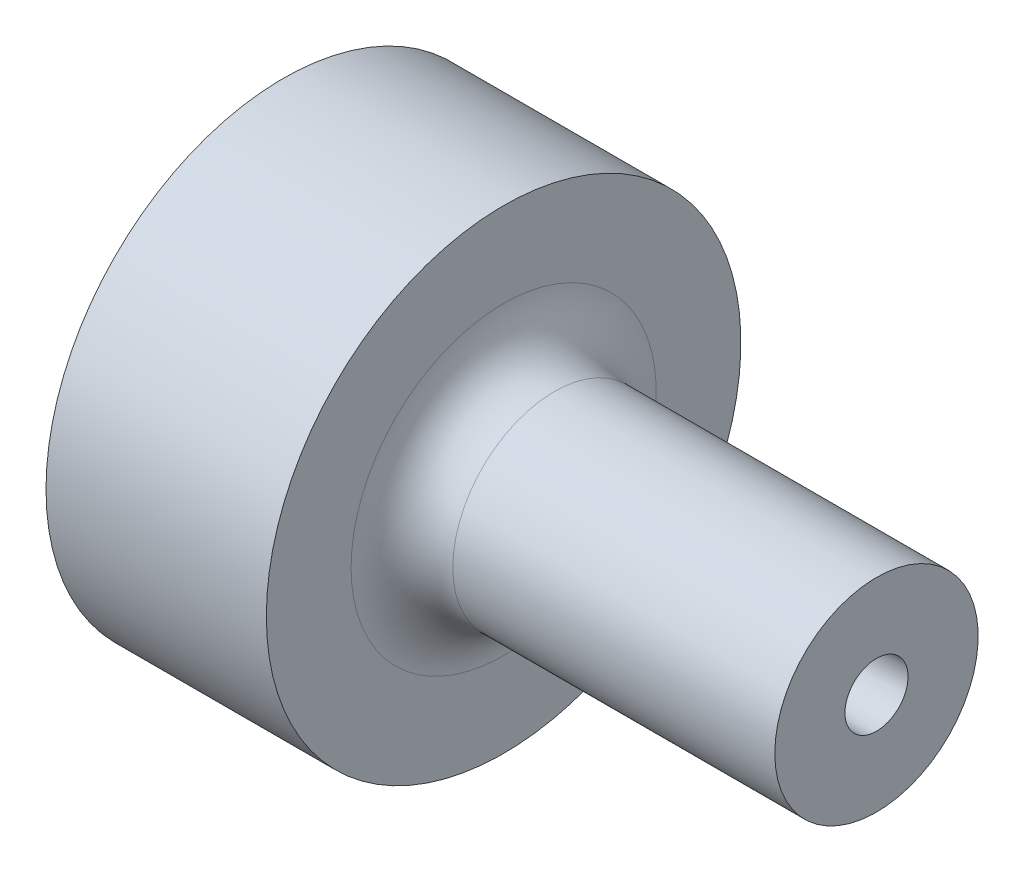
ISO-10303-21;
HEADER;
FILE_DESCRIPTION(('STEP AP214'),'2;1');
FILE_NAME('part.step','',(''),(''),'','','');
FILE_SCHEMA(('AUTOMOTIVE_DESIGN { 1 0 10303 214 1 1 1 1 }'));
ENDSEC;
DATA;
#1=APPLICATION_CONTEXT('core data for automotive mechanical design processes');
#2=APPLICATION_PROTOCOL_DEFINITION('international standard','automotive_design',2000,#1);
#3=PRODUCT_CONTEXT('',#1,'mechanical');
#4=PRODUCT('Part','Part','',(#3));
#5=PRODUCT_RELATED_PRODUCT_CATEGORY('part','',(#4));
#6=PRODUCT_DEFINITION_FORMATION('','',#4);
#7=PRODUCT_DEFINITION_CONTEXT('part definition',#1,'design');
#8=PRODUCT_DEFINITION('design','',#6,#7);
#9=PRODUCT_DEFINITION_SHAPE('','',#8);
#10=(LENGTH_UNIT() NAMED_UNIT(*) SI_UNIT(.MILLI.,.METRE.));
#11=(NAMED_UNIT(*) PLANE_ANGLE_UNIT() SI_UNIT($,.RADIAN.));
#12=(NAMED_UNIT(*) SI_UNIT($,.STERADIAN.) SOLID_ANGLE_UNIT());
#13=UNCERTAINTY_MEASURE_WITH_UNIT(LENGTH_MEASURE(1.E-05),#10,'distance_accuracy_value','');
#14=(GEOMETRIC_REPRESENTATION_CONTEXT(3) GLOBAL_UNCERTAINTY_ASSIGNED_CONTEXT((#13)) GLOBAL_UNIT_ASSIGNED_CONTEXT((#10,
#11,#12)) REPRESENTATION_CONTEXT('',''));
#15=CARTESIAN_POINT('',(0.,0.,0.));
#16=DIRECTION('',(0.,0.,1.));
#17=DIRECTION('',(1.,0.,0.));
#18=AXIS2_PLACEMENT_3D('',#15,#16,#17);
#19=CARTESIAN_POINT('',(0.,0.,0.));
#20=DIRECTION('',(-1.,0.,0.));
#21=DIRECTION('',(0.,0.,1.));
#22=AXIS2_PLACEMENT_3D('',#19,#20,#21);
#23=CYLINDRICAL_SURFACE('',#22,14.);
#24=CARTESIAN_POINT('',(13.,0.,0.));
#25=DIRECTION('',(-1.,0.,0.));
#26=DIRECTION('',(0.,0.,1.));
#27=AXIS2_PLACEMENT_3D('',#24,#25,#26);
#28=CIRCLE('',#27,14.);
#29=CARTESIAN_POINT('',(13.,0.,14.));
#30=VERTEX_POINT('',#29);
#31=EDGE_CURVE('E88',#30,#30,#28,.T.);
#32=ORIENTED_EDGE('',*,*,#31,.T.);
#33=EDGE_LOOP('',(#32));
#34=FACE_BOUND('',#33,.T.);
#35=CARTESIAN_POINT('',(0.,0.,0.));
#36=DIRECTION('',(-1.,0.,0.));
#37=DIRECTION('',(0.,0.,1.));
#38=AXIS2_PLACEMENT_3D('',#35,#36,#37);
#39=CIRCLE('',#38,14.);
#40=CARTESIAN_POINT('',(0.,0.,14.));
#41=VERTEX_POINT('',#40);
#42=EDGE_CURVE('E83',#41,#41,#39,.T.);
#43=ORIENTED_EDGE('',*,*,#42,.F.);
#44=EDGE_LOOP('',(#43));
#45=FACE_BOUND('',#44,.T.);
#46=CARTESIAN_POINT('',(6.5,-13.856406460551,-2.));
#47=CARTESIAN_POINT('',(6.61172417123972,-13.8564082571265,-1.99999534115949));
#48=CARTESIAN_POINT('',(6.72351471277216,-13.8577723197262,-1.99060664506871));
#49=CARTESIAN_POINT('',(6.9439746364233,-13.8630779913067,-1.95330740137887));
#50=CARTESIAN_POINT('',(7.05264079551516,-13.8670221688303,-1.92537839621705));
#51=CARTESIAN_POINT('',(7.26362870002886,-13.8770324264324,-1.85184738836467));
#52=CARTESIAN_POINT('',(7.36595507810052,-13.8830969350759,-1.80625847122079));
#53=CARTESIAN_POINT('',(7.56148972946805,-13.8966626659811,-1.69873175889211));
#54=CARTESIAN_POINT('',(7.65469934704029,-13.9041636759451,-1.63679637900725));
#55=CARTESIAN_POINT('',(7.83004829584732,-13.9198182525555,-1.49785346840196));
#56=CARTESIAN_POINT('',(7.91211171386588,-13.9279757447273,-1.42075056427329));
#57=CARTESIAN_POINT('',(8.06218155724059,-13.9439890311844,-1.25386707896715));
#58=CARTESIAN_POINT('',(8.13018723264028,-13.9518448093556,-1.16408582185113));
#59=CARTESIAN_POINT('',(8.25048909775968,-13.9664103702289,-0.973910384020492));
#60=CARTESIAN_POINT('',(8.30271571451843,-13.9731150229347,-0.873471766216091));
#61=CARTESIAN_POINT('',(8.38953073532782,-13.9845795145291,-0.665136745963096));
#62=CARTESIAN_POINT('',(8.4241199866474,-13.9893394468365,-0.557240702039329));
#63=CARTESIAN_POINT('',(8.47444920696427,-13.9963505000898,-0.337834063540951));
#64=CARTESIAN_POINT('',(8.49031606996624,-13.9986185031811,-0.226353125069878));
#65=CARTESIAN_POINT('',(8.5031438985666,-14.0004479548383,-0.00228956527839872));
#66=CARTESIAN_POINT('',(8.50010582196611,-14.0000095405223,0.110292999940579));
#67=CARTESIAN_POINT('',(8.47531062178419,-13.9964890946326,0.33249899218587));
#68=CARTESIAN_POINT('',(8.45369000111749,-13.9934263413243,0.442137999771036));
#69=CARTESIAN_POINT('',(8.39255744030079,-13.9850228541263,0.656215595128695));
#70=CARTESIAN_POINT('',(8.3530450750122,-13.9796820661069,0.760654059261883));
#71=CARTESIAN_POINT('',(8.25710925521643,-13.9672894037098,0.961781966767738));
#72=CARTESIAN_POINT('',(8.20062784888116,-13.9602316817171,1.05844339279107));
#73=CARTESIAN_POINT('',(8.07239950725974,-13.9451926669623,1.24096782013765));
#74=CARTESIAN_POINT('',(8.00065165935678,-13.9372113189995,1.32683017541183));
#75=CARTESIAN_POINT('',(7.843165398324,-13.921132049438,1.48612299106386));
#76=CARTESIAN_POINT('',(7.75730786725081,-13.9130337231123,1.55943569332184));
#77=CARTESIAN_POINT('',(7.57444547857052,-13.8977029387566,1.69062989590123));
#78=CARTESIAN_POINT('',(7.47744056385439,-13.890470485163,1.74851131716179));
#79=CARTESIAN_POINT('',(7.27491971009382,-13.8776905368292,1.84721301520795));
#80=CARTESIAN_POINT('',(7.1693981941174,-13.8721441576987,1.88802200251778));
#81=CARTESIAN_POINT('',(6.95290242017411,-13.8633846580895,1.9513062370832));
#82=CARTESIAN_POINT('',(6.84192850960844,-13.8601713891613,1.97378265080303));
#83=CARTESIAN_POINT('',(6.61872346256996,-13.8564698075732,1.99960390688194));
#84=CARTESIAN_POINT('',(6.50651197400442,-13.8559577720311,2.00311531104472));
#85=CARTESIAN_POINT('',(6.28310219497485,-13.8576537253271,1.9913480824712));
#86=CARTESIAN_POINT('',(6.17190387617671,-13.8598616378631,1.9760699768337));
#87=CARTESIAN_POINT('',(5.95418781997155,-13.8667269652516,1.92729837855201));
#88=CARTESIAN_POINT('',(5.84765127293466,-13.8713733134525,1.8938871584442));
#89=CARTESIAN_POINT('',(5.6416912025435,-13.8825829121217,1.80988306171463));
#90=CARTESIAN_POINT('',(5.54226800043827,-13.8891462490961,1.75928940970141));
#91=CARTESIAN_POINT('',(5.35260812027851,-13.9035064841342,1.64195360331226));
#92=CARTESIAN_POINT('',(5.26243903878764,-13.911311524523,1.57510320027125));
#93=CARTESIAN_POINT('',(5.09454027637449,-13.9272509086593,1.42730277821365));
#94=CARTESIAN_POINT('',(5.01681123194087,-13.9353852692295,1.34635203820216));
#95=CARTESIAN_POINT('',(4.8754047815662,-13.9511405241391,1.17191708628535));
#96=CARTESIAN_POINT('',(4.81183747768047,-13.9587570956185,1.07834317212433));
#97=CARTESIAN_POINT('',(4.70132443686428,-13.972552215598,0.881748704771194));
#98=CARTESIAN_POINT('',(4.65437828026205,-13.9787308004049,0.778728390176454));
#99=CARTESIAN_POINT('',(4.57861788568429,-13.9889347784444,0.566515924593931));
#100=CARTESIAN_POINT('',(4.54974241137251,-13.9929674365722,0.457345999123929));
#101=CARTESIAN_POINT('',(4.51074453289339,-13.9984555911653,0.235645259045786));
#102=CARTESIAN_POINT('',(4.50062101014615,-13.9999112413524,0.123114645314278));
#103=CARTESIAN_POINT('',(4.49943976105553,-14.0000800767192,-0.101043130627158));
#104=CARTESIAN_POINT('',(4.50821318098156,-13.998817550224,-0.212669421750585));
#105=CARTESIAN_POINT('',(4.54421615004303,-13.9937406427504,-0.432842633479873));
#106=CARTESIAN_POINT('',(4.57144565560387,-13.989926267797,-0.541389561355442));
#107=CARTESIAN_POINT('',(4.6435299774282,-13.9801722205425,-0.752283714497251));
#108=CARTESIAN_POINT('',(4.68837418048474,-13.9742338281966,-0.854634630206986));
#109=CARTESIAN_POINT('',(4.79439714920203,-13.960885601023,-1.05038570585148));
#110=CARTESIAN_POINT('',(4.8555763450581,-13.9534757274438,-1.14378562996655));
#111=CARTESIAN_POINT('',(4.99314771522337,-13.9379304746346,-1.31984194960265));
#112=CARTESIAN_POINT('',(5.06966490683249,-13.9297894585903,-1.40240016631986));
#113=CARTESIAN_POINT('',(5.2354775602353,-13.9137422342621,-1.55356716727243));
#114=CARTESIAN_POINT('',(5.32477602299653,-13.9058360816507,-1.6221726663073));
#115=CARTESIAN_POINT('',(5.51414543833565,-13.8911108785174,-1.74379523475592));
#116=CARTESIAN_POINT('',(5.61426869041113,-13.8842975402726,-1.79673154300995));
#117=CARTESIAN_POINT('',(5.82203229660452,-13.8725962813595,-1.88495902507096));
#118=CARTESIAN_POINT('',(5.92966459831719,-13.8677063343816,-1.92026877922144));
#119=CARTESIAN_POINT('',(6.11483642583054,-13.8615529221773,-1.96409255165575));
#120=CARTESIAN_POINT('',(6.19122433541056,-13.859633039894,-1.97753762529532));
#121=CARTESIAN_POINT('',(6.34506419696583,-13.857059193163,-1.99549291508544));
#122=CARTESIAN_POINT('',(6.42251613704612,-13.8564052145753,-2.00000323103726));
#123=CARTESIAN_POINT('',(6.5,-13.856406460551,-2.));
#124=B_SPLINE_CURVE_WITH_KNOTS('',3,(#46,#47,#48,#49,#50,#51,#52,#53,#54,#55,#56,#57,#58,#59,
#60,#61,#62,#63,#64,#65,#66,#67,#68,#69,#70,#71,#72,#73,#74,#75,#76,#77,#78,#79,#80,#81,#82,#83,
#84,#85,#86,#87,#88,#89,#90,#91,#92,#93,#94,#95,#96,#97,#98,#99,#100,#101,#102,#103,#104,#105,
#106,#107,#108,#109,#110,#111,#112,#113,#114,#115,#116,#117,#118,#119,#120,#121,#122,#123),
.UNSPECIFIED.,.T.,.F.,(4,2,2,2,2,2,2,2,2,2,2,2,2,2,2,2,2,2,2,2,2,2,2,2,2,2,2,2,2,2,2,2,2,2,2,2,
2,2,4),(0.,0.334889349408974,0.670112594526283,1.00508792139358,1.34001378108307,
1.6771171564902,2.01423851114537,2.35282530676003,2.6913958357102,3.02765822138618,
3.36390357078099,3.69769984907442,4.03150405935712,4.36646147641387,4.70143892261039,
5.03940517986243,5.37737316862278,5.7155642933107,6.05373389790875,6.3889286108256,
6.72411392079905,7.05779100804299,7.39148315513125,7.72746121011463,8.06345644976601,
8.40197921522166,8.74049343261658,9.07785422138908,9.41519488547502,9.74953375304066,
10.083871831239,10.4180087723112,10.7521545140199,11.0891434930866,11.426211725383,
11.7649881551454,12.103406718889,12.3356645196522,12.5679197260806),.UNSPECIFIED.);
#125=CARTESIAN_POINT('',(6.5,-13.856406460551,-2.));
#126=VERTEX_POINT('',#125);
#127=EDGE_CURVE('E9',#126,#126,#124,.T.);
#128=ORIENTED_EDGE('',*,*,#127,.F.);
#129=EDGE_LOOP('',(#128));
#130=FACE_BOUND('',#129,.T.);
#131=ADVANCED_FACE('F15',(#34,#45,#130),#23,.T.);
#132=CARTESIAN_POINT('',(0.,0.,0.));
#133=DIRECTION('',(1.,0.,0.));
#134=DIRECTION('',(0.,0.,-1.));
#135=AXIS2_PLACEMENT_3D('',#132,#133,#134);
#136=CONICAL_SURFACE('',#135,1.25,0.0174532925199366);
#137=CARTESIAN_POINT('',(35.,0.,0.));
#138=DIRECTION('',(-1.,0.,0.));
#139=DIRECTION('',(0.,0.,1.));
#140=AXIS2_PLACEMENT_3D('',#137,#138,#139);
#141=CIRCLE('',#140,1.86092727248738);
#142=CARTESIAN_POINT('',(35.,0.,1.86092727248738));
#143=VERTEX_POINT('',#142);
#144=EDGE_CURVE('E80',#143,#143,#141,.T.);
#145=ORIENTED_EDGE('',*,*,#144,.F.);
#146=EDGE_LOOP('',(#145));
#147=FACE_BOUND('',#146,.T.);
#148=CARTESIAN_POINT('',(1.22738614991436,0.,0.));
#149=DIRECTION('',(-1.,0.,0.));
#150=DIRECTION('',(0.,0.,1.));
#151=AXIS2_PLACEMENT_3D('',#148,#149,#150);
#152=CIRCLE('',#151,1.27142410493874);
#153=CARTESIAN_POINT('',(1.22738614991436,0.,1.27142410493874));
#154=VERTEX_POINT('',#153);
#155=EDGE_CURVE('E93',#154,#154,#152,.F.);
#156=ORIENTED_EDGE('',*,*,#155,.F.);
#157=EDGE_LOOP('',(#156));
#158=FACE_BOUND('',#157,.T.);
#159=ADVANCED_FACE('F44',(#147,#158),#136,.F.);
#160=CARTESIAN_POINT('',(16.,0.,0.));
#161=DIRECTION('',(-1.,0.,0.));
#162=DIRECTION('',(0.,0.,1.));
#163=AXIS2_PLACEMENT_3D('',#160,#161,#162);
#164=TOROIDAL_SURFACE('',#163,9.,3.);
#165=CARTESIAN_POINT('',(13.,0.,0.));
#166=DIRECTION('',(-1.,0.,0.));
#167=DIRECTION('',(0.,0.,1.));
#168=AXIS2_PLACEMENT_3D('',#165,#166,#167);
#169=CIRCLE('',#168,9.);
#170=CARTESIAN_POINT('',(13.,0.,9.));
#171=VERTEX_POINT('',#170);
#172=EDGE_CURVE('E90',#171,#171,#169,.T.);
#173=ORIENTED_EDGE('',*,*,#172,.F.);
#174=EDGE_LOOP('',(#173));
#175=FACE_BOUND('',#174,.T.);
#176=CARTESIAN_POINT('',(16.,0.,0.));
#177=DIRECTION('',(-1.,0.,0.));
#178=DIRECTION('',(0.,0.,1.));
#179=AXIS2_PLACEMENT_3D('',#176,#177,#178);
#180=CIRCLE('',#179,6.);
#181=CARTESIAN_POINT('',(16.,0.,6.));
#182=VERTEX_POINT('',#181);
#183=EDGE_CURVE('E27',#182,#182,#180,.T.);
#184=ORIENTED_EDGE('',*,*,#183,.T.);
#185=EDGE_LOOP('',(#184));
#186=FACE_BOUND('',#185,.T.);
#187=ADVANCED_FACE('F17',(#175,#186),#164,.F.);
#188=CARTESIAN_POINT('',(0.,0.,0.));
#189=DIRECTION('',(-1.,0.,0.));
#190=DIRECTION('',(0.,0.,1.));
#191=AXIS2_PLACEMENT_3D('',#188,#189,#190);
#192=CYLINDRICAL_SURFACE('',#191,6.);
#193=ORIENTED_EDGE('',*,*,#183,.F.);
#194=EDGE_LOOP('',(#193));
#195=FACE_BOUND('',#194,.T.);
#196=CARTESIAN_POINT('',(35.,0.,0.));
#197=DIRECTION('',(-1.,0.,0.));
#198=DIRECTION('',(0.,0.,1.));
#199=AXIS2_PLACEMENT_3D('',#196,#197,#198);
#200=CIRCLE('',#199,6.);
#201=CARTESIAN_POINT('',(35.,0.,6.));
#202=VERTEX_POINT('',#201);
#203=EDGE_CURVE('E79',#202,#202,#200,.T.);
#204=ORIENTED_EDGE('',*,*,#203,.T.);
#205=EDGE_LOOP('',(#204));
#206=FACE_BOUND('',#205,.T.);
#207=ADVANCED_FACE('F65',(#195,#206),#192,.T.);
#208=CARTESIAN_POINT('',(35.,6.,0.));
#209=DIRECTION('',(-1.,0.,0.));
#210=DIRECTION('',(0.,0.,1.));
#211=AXIS2_PLACEMENT_3D('',#208,#209,#210);
#212=PLANE('',#211);
#213=ORIENTED_EDGE('',*,*,#203,.F.);
#214=EDGE_LOOP('',(#213));
#215=FACE_BOUND('',#214,.T.);
#216=ORIENTED_EDGE('',*,*,#144,.T.);
#217=EDGE_LOOP('',(#216));
#218=FACE_BOUND('',#217,.T.);
#219=ADVANCED_FACE('F61',(#215,#218),#212,.F.);
#220=CARTESIAN_POINT('',(0.,1.25,0.));
#221=DIRECTION('',(1.,0.,0.));
#222=DIRECTION('',(0.,0.,-1.));
#223=AXIS2_PLACEMENT_3D('',#220,#221,#222);
#224=PLANE('',#223);
#225=CARTESIAN_POINT('',(0.,0.,0.));
#226=DIRECTION('',(-1.,0.,0.));
#227=DIRECTION('',(0.,0.,1.));
#228=AXIS2_PLACEMENT_3D('',#225,#226,#227);
#229=CIRCLE('',#228,5.);
#230=CARTESIAN_POINT('',(0.,0.,5.));
#231=VERTEX_POINT('',#230);
#232=EDGE_CURVE('E96',#231,#231,#229,.T.);
#233=ORIENTED_EDGE('',*,*,#232,.F.);
#234=EDGE_LOOP('',(#233));
#235=FACE_BOUND('',#234,.T.);
#236=ORIENTED_EDGE('',*,*,#42,.T.);
#237=EDGE_LOOP('',(#236));
#238=FACE_BOUND('',#237,.T.);
#239=ADVANCED_FACE('F59',(#235,#238),#224,.F.);
#240=CARTESIAN_POINT('',(13.,14.,0.));
#241=DIRECTION('',(-1.,0.,0.));
#242=DIRECTION('',(0.,0.,1.));
#243=AXIS2_PLACEMENT_3D('',#240,#241,#242);
#244=PLANE('',#243);
#245=ORIENTED_EDGE('',*,*,#31,.F.);
#246=EDGE_LOOP('',(#245));
#247=FACE_BOUND('',#246,.T.);
#248=ORIENTED_EDGE('',*,*,#172,.T.);
#249=EDGE_LOOP('',(#248));
#250=FACE_BOUND('',#249,.T.);
#251=ADVANCED_FACE('F57',(#247,#250),#244,.F.);
#252=CARTESIAN_POINT('',(-37.3349076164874,0.,0.));
#253=DIRECTION('',(-1.,0.,0.));
#254=DIRECTION('',(0.,0.,1.));
#255=AXIS2_PLACEMENT_3D('',#252,#253,#254);
#256=DEGENERATE_TOROIDAL_SURFACE('',#255,9.35634609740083,40.,.F.);
#257=ORIENTED_EDGE('',*,*,#232,.T.);
#258=EDGE_LOOP('',(#257));
#259=FACE_BOUND('',#258,.T.);
#260=ORIENTED_EDGE('',*,*,#155,.T.);
#261=EDGE_LOOP('',(#260));
#262=FACE_BOUND('',#261,.T.);
#263=ADVANCED_FACE('F40',(#259,#262),#256,.T.);
#264=CARTESIAN_POINT('',(6.5,-14.,0.));
#265=DIRECTION('',(0.,-1.,0.));
#266=DIRECTION('',(0.,0.,-1.));
#267=AXIS2_PLACEMENT_3D('',#264,#265,#266);
#268=CYLINDRICAL_SURFACE('',#267,2.);
#269=CARTESIAN_POINT('',(6.5,-8.,0.));
#270=DIRECTION('',(0.,-1.,0.));
#271=DIRECTION('',(0.,0.,-1.));
#272=AXIS2_PLACEMENT_3D('',#269,#270,#271);
#273=CIRCLE('',#272,2.);
#274=CARTESIAN_POINT('',(6.5,-8.,-2.));
#275=VERTEX_POINT('',#274);
#276=EDGE_CURVE('E99',#275,#275,#273,.T.);
#277=ORIENTED_EDGE('',*,*,#276,.F.);
#278=EDGE_LOOP('',(#277));
#279=FACE_BOUND('',#278,.T.);
#280=ORIENTED_EDGE('',*,*,#127,.T.);
#281=EDGE_LOOP('',(#280));
#282=FACE_BOUND('',#281,.T.);
#283=ADVANCED_FACE('F32',(#279,#282),#268,.F.);
#284=CARTESIAN_POINT('',(6.5,-6.84529946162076,0.));
#285=DIRECTION('',(0.,-1.,0.));
#286=DIRECTION('',(0.,0.,-1.));
#287=AXIS2_PLACEMENT_3D('',#284,#285,#286);
#288=CONICAL_SURFACE('',#287,0.,1.0471975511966);
#289=ORIENTED_EDGE('',*,*,#276,.T.);
#290=EDGE_LOOP('',(#289));
#291=FACE_BOUND('',#290,.T.);
#292=CARTESIAN_POINT('',(6.5,-6.84529946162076,0.));
#293=VERTEX_POINT('',#292);
#294=VERTEX_LOOP('',#293);
#295=FACE_BOUND('',#294,.T.);
#296=ADVANCED_FACE('F30',(#291,#295),#288,.F.);
#297=CLOSED_SHELL('',(#131,#159,#187,#207,#219,#239,#251,#263,#283,#296));
#298=MANIFOLD_SOLID_BREP('B1',#297);
#299=ADVANCED_BREP_SHAPE_REPRESENTATION('',(#18,#298),#14);
#300=SHAPE_DEFINITION_REPRESENTATION(#9,#299);
ENDSEC;
END-ISO-10303-21;
